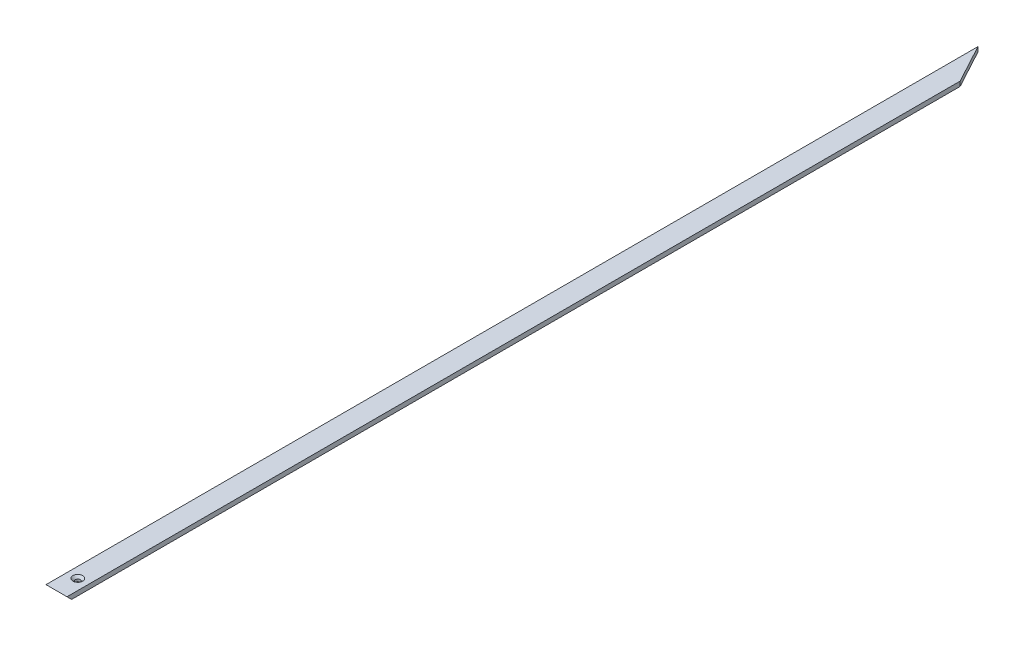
ISO-10303-21;
HEADER;
FILE_DESCRIPTION(('STEP AP214'),'2;1');
FILE_NAME('part.step','',(''),(''),'','','');
FILE_SCHEMA(('AUTOMOTIVE_DESIGN { 1 0 10303 214 1 1 1 1 }'));
ENDSEC;
DATA;
#1=APPLICATION_CONTEXT('core data for automotive mechanical design processes');
#2=APPLICATION_PROTOCOL_DEFINITION('international standard','automotive_design',2000,#1);
#3=PRODUCT_CONTEXT('',#1,'mechanical');
#4=PRODUCT('Part','Part','',(#3));
#5=PRODUCT_RELATED_PRODUCT_CATEGORY('part','',(#4));
#6=PRODUCT_DEFINITION_FORMATION('','',#4);
#7=PRODUCT_DEFINITION_CONTEXT('part definition',#1,'design');
#8=PRODUCT_DEFINITION('design','',#6,#7);
#9=PRODUCT_DEFINITION_SHAPE('','',#8);
#10=(LENGTH_UNIT() NAMED_UNIT(*) SI_UNIT(.MILLI.,.METRE.));
#11=(NAMED_UNIT(*) PLANE_ANGLE_UNIT() SI_UNIT($,.RADIAN.));
#12=(NAMED_UNIT(*) SI_UNIT($,.STERADIAN.) SOLID_ANGLE_UNIT());
#13=UNCERTAINTY_MEASURE_WITH_UNIT(LENGTH_MEASURE(1.E-05),#10,'distance_accuracy_value','');
#14=(GEOMETRIC_REPRESENTATION_CONTEXT(3) GLOBAL_UNCERTAINTY_ASSIGNED_CONTEXT((#13)) GLOBAL_UNIT_ASSIGNED_CONTEXT((#10,
#11,#12)) REPRESENTATION_CONTEXT('',''));
#15=CARTESIAN_POINT('',(0.,0.,0.));
#16=DIRECTION('',(0.,0.,1.));
#17=DIRECTION('',(1.,0.,0.));
#18=AXIS2_PLACEMENT_3D('',#15,#16,#17);
#19=CARTESIAN_POINT('',(-13.5,0.,600.));
#20=DIRECTION('',(1.,0.,0.));
#21=DIRECTION('',(0.,0.,-1.));
#22=AXIS2_PLACEMENT_3D('',#19,#20,#21);
#23=PLANE('',#22);
#24=DIRECTION('',(0.,0.,-1.));
#25=VECTOR('',#24,1.);
#26=CARTESIAN_POINT('',(-13.5,0.,600.));
#27=LINE('',#26,#25);
#28=CARTESIAN_POINT('',(-13.5,0.,594.));
#29=VERTEX_POINT('',#28);
#30=CARTESIAN_POINT('',(-13.5,0.,-600.));
#31=VERTEX_POINT('',#30);
#32=EDGE_CURVE('E74',#29,#31,#27,.T.);
#33=ORIENTED_EDGE('',*,*,#32,.F.);
#34=DIRECTION('',(0.,-0.707106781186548,-0.707106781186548));
#35=VECTOR('',#34,1.);
#36=CARTESIAN_POINT('',(-13.5,6.00000000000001,600.));
#37=LINE('',#36,#35);
#38=CARTESIAN_POINT('',(-13.5,6.,600.));
#39=VERTEX_POINT('',#38);
#40=EDGE_CURVE('E99',#29,#39,#37,.F.);
#41=ORIENTED_EDGE('',*,*,#40,.T.);
#42=DIRECTION('',(0.,0.,-1.));
#43=VECTOR('',#42,1.);
#44=CARTESIAN_POINT('',(-13.5,6.,600.));
#45=LINE('',#44,#43);
#46=CARTESIAN_POINT('',(-13.5,6.,-600.));
#47=VERTEX_POINT('',#46);
#48=EDGE_CURVE('E88',#39,#47,#45,.T.);
#49=ORIENTED_EDGE('',*,*,#48,.T.);
#50=DIRECTION('',(0.,-1.,0.));
#51=VECTOR('',#50,1.);
#52=CARTESIAN_POINT('',(-13.5,0.,-600.));
#53=LINE('',#52,#51);
#54=EDGE_CURVE('E86',#47,#31,#53,.T.);
#55=ORIENTED_EDGE('',*,*,#54,.T.);
#56=EDGE_LOOP('',(#33,#41,#49,#55));
#57=FACE_BOUND('',#56,.T.);
#58=ADVANCED_FACE('F36',(#57),#23,.F.);
#59=CARTESIAN_POINT('',(-13.5,0.,600.));
#60=DIRECTION('',(0.,1.,0.));
#61=DIRECTION('',(0.,0.,1.));
#62=AXIS2_PLACEMENT_3D('',#59,#60,#61);
#63=PLANE('',#62);
#64=CARTESIAN_POINT('',(0.,0.,572.5));
#65=DIRECTION('',(0.,1.,0.));
#66=DIRECTION('',(0.,0.,1.));
#67=AXIS2_PLACEMENT_3D('',#64,#65,#66);
#68=CIRCLE('',#67,3.25);
#69=CARTESIAN_POINT('',(0.,0.,575.75));
#70=VERTEX_POINT('',#69);
#71=EDGE_CURVE('E126',#70,#70,#68,.T.);
#72=ORIENTED_EDGE('',*,*,#71,.T.);
#73=EDGE_LOOP('',(#72));
#74=FACE_BOUND('',#73,.T.);
#75=ORIENTED_EDGE('',*,*,#32,.T.);
#76=DIRECTION('',(0.475148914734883,0.,0.879905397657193));
#77=VECTOR('',#76,1.);
#78=CARTESIAN_POINT('',(13.5,0.,-550.));
#79=LINE('',#78,#77);
#80=CARTESIAN_POINT('',(13.5000000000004,0.,-549.999999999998));
#81=VERTEX_POINT('',#80);
#82=EDGE_CURVE('E11',#31,#81,#79,.T.);
#83=ORIENTED_EDGE('',*,*,#82,.T.);
#84=DIRECTION('',(0.,0.,-1.));
#85=VECTOR('',#84,1.);
#86=CARTESIAN_POINT('',(13.5,0.,600.));
#87=LINE('',#86,#85);
#88=CARTESIAN_POINT('',(13.5,0.,594.));
#89=VERTEX_POINT('',#88);
#90=EDGE_CURVE('E83',#89,#81,#87,.T.);
#91=ORIENTED_EDGE('',*,*,#90,.F.);
#92=DIRECTION('',(-1.,0.,0.));
#93=VECTOR('',#92,1.);
#94=CARTESIAN_POINT('',(-13.5,0.,594.));
#95=LINE('',#94,#93);
#96=EDGE_CURVE('E78',#89,#29,#95,.T.);
#97=ORIENTED_EDGE('',*,*,#96,.T.);
#98=EDGE_LOOP('',(#75,#83,#91,#97));
#99=FACE_BOUND('',#98,.T.);
#100=ADVANCED_FACE('F76',(#74,#99),#63,.F.);
#101=CARTESIAN_POINT('',(13.5,0.,600.));
#102=DIRECTION('',(-1.,0.,0.));
#103=DIRECTION('',(0.,0.,1.));
#104=AXIS2_PLACEMENT_3D('',#101,#102,#103);
#105=PLANE('',#104);
#106=ORIENTED_EDGE('',*,*,#90,.T.);
#107=DIRECTION('',(0.,1.,0.));
#108=VECTOR('',#107,1.);
#109=CARTESIAN_POINT('',(13.5,6.,-550.));
#110=LINE('',#109,#108);
#111=CARTESIAN_POINT('',(13.5000000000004,6.,-549.999999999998));
#112=VERTEX_POINT('',#111);
#113=EDGE_CURVE('E94',#81,#112,#110,.T.);
#114=ORIENTED_EDGE('',*,*,#113,.T.);
#115=DIRECTION('',(0.,0.,-1.));
#116=VECTOR('',#115,1.);
#117=CARTESIAN_POINT('',(13.5,6.,600.));
#118=LINE('',#117,#116);
#119=CARTESIAN_POINT('',(13.5,6.,600.));
#120=VERTEX_POINT('',#119);
#121=EDGE_CURVE('E111',#120,#112,#118,.T.);
#122=ORIENTED_EDGE('',*,*,#121,.F.);
#123=DIRECTION('',(0.,0.707106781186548,0.707106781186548));
#124=VECTOR('',#123,1.);
#125=CARTESIAN_POINT('',(13.5,6.00000000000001,600.));
#126=LINE('',#125,#124);
#127=EDGE_CURVE('E82',#120,#89,#126,.F.);
#128=ORIENTED_EDGE('',*,*,#127,.T.);
#129=EDGE_LOOP('',(#106,#114,#122,#128));
#130=FACE_BOUND('',#129,.T.);
#131=ADVANCED_FACE('F148',(#130),#105,.F.);
#132=CARTESIAN_POINT('',(-13.5,6.,600.));
#133=DIRECTION('',(0.,-1.,0.));
#134=DIRECTION('',(0.,0.,-1.));
#135=AXIS2_PLACEMENT_3D('',#132,#133,#134);
#136=PLANE('',#135);
#137=CARTESIAN_POINT('',(0.,6.,572.5));
#138=DIRECTION('',(0.,1.,0.));
#139=DIRECTION('',(0.,0.,1.));
#140=AXIS2_PLACEMENT_3D('',#137,#138,#139);
#141=CIRCLE('',#140,6.3);
#142=CARTESIAN_POINT('',(0.,6.,578.8));
#143=VERTEX_POINT('',#142);
#144=EDGE_CURVE('E91',#143,#143,#141,.T.);
#145=ORIENTED_EDGE('',*,*,#144,.F.);
#146=EDGE_LOOP('',(#145));
#147=FACE_BOUND('',#146,.T.);
#148=ORIENTED_EDGE('',*,*,#121,.T.);
#149=DIRECTION('',(-0.475148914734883,0.,-0.879905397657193));
#150=VECTOR('',#149,1.);
#151=CARTESIAN_POINT('',(13.5,6.,-550.));
#152=LINE('',#151,#150);
#153=EDGE_CURVE('E44',#112,#47,#152,.T.);
#154=ORIENTED_EDGE('',*,*,#153,.T.);
#155=ORIENTED_EDGE('',*,*,#48,.F.);
#156=DIRECTION('',(-1.,0.,0.));
#157=VECTOR('',#156,1.);
#158=CARTESIAN_POINT('',(-13.5,6.,600.));
#159=LINE('',#158,#157);
#160=EDGE_CURVE('E90',#120,#39,#159,.T.);
#161=ORIENTED_EDGE('',*,*,#160,.F.);
#162=EDGE_LOOP('',(#148,#154,#155,#161));
#163=FACE_BOUND('',#162,.T.);
#164=ADVANCED_FACE('F144',(#147,#163),#136,.F.);
#165=CARTESIAN_POINT('',(-13.5,6.00000000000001,600.));
#166=DIRECTION('',(0.,0.707106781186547,-0.707106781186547));
#167=DIRECTION('',(0.,0.707106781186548,0.707106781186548));
#168=AXIS2_PLACEMENT_3D('',#165,#166,#167);
#169=PLANE('',#168);
#170=ORIENTED_EDGE('',*,*,#40,.F.);
#171=ORIENTED_EDGE('',*,*,#96,.F.);
#172=ORIENTED_EDGE('',*,*,#127,.F.);
#173=ORIENTED_EDGE('',*,*,#160,.T.);
#174=EDGE_LOOP('',(#170,#171,#172,#173));
#175=FACE_BOUND('',#174,.T.);
#176=ADVANCED_FACE('F147',(#175),#169,.F.);
#177=CARTESIAN_POINT('',(13.5,0.,-550.));
#178=DIRECTION('',(0.879905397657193,0.,-0.475148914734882));
#179=DIRECTION('',(-0.475148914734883,0.,-0.879905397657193));
#180=AXIS2_PLACEMENT_3D('',#177,#178,#179);
#181=PLANE('',#180);
#182=ORIENTED_EDGE('',*,*,#82,.F.);
#183=ORIENTED_EDGE('',*,*,#54,.F.);
#184=ORIENTED_EDGE('',*,*,#153,.F.);
#185=ORIENTED_EDGE('',*,*,#113,.F.);
#186=EDGE_LOOP('',(#182,#183,#184,#185));
#187=FACE_BOUND('',#186,.T.);
#188=ADVANCED_FACE('F93',(#187),#181,.T.);
#189=CARTESIAN_POINT('',(0.,6.,572.5));
#190=DIRECTION('',(0.,1.,0.));
#191=DIRECTION('',(0.,0.,1.));
#192=AXIS2_PLACEMENT_3D('',#189,#190,#191);
#193=CONICAL_SURFACE('',#192,6.3,0.785398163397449);
#194=CARTESIAN_POINT('',(0.,2.95,572.5));
#195=DIRECTION('',(0.,1.,0.));
#196=DIRECTION('',(0.,0.,1.));
#197=AXIS2_PLACEMENT_3D('',#194,#195,#196);
#198=CIRCLE('',#197,3.25);
#199=CARTESIAN_POINT('',(0.,2.95,575.75));
#200=VERTEX_POINT('',#199);
#201=EDGE_CURVE('E122',#200,#200,#198,.T.);
#202=ORIENTED_EDGE('',*,*,#201,.F.);
#203=EDGE_LOOP('',(#202));
#204=FACE_BOUND('',#203,.T.);
#205=ORIENTED_EDGE('',*,*,#144,.T.);
#206=EDGE_LOOP('',(#205));
#207=FACE_BOUND('',#206,.T.);
#208=ADVANCED_FACE('F135',(#204,#207),#193,.F.);
#209=CARTESIAN_POINT('',(0.,6.,572.5));
#210=DIRECTION('',(0.,1.,0.));
#211=DIRECTION('',(0.,0.,1.));
#212=AXIS2_PLACEMENT_3D('',#209,#210,#211);
#213=CYLINDRICAL_SURFACE('',#212,3.25);
#214=ORIENTED_EDGE('',*,*,#71,.F.);
#215=EDGE_LOOP('',(#214));
#216=FACE_BOUND('',#215,.T.);
#217=ORIENTED_EDGE('',*,*,#201,.T.);
#218=EDGE_LOOP('',(#217));
#219=FACE_BOUND('',#218,.T.);
#220=ADVANCED_FACE('F132',(#216,#219),#213,.F.);
#221=CLOSED_SHELL('',(#58,#100,#131,#164,#176,#188,#208,#220));
#222=MANIFOLD_SOLID_BREP('B2',#221);
#223=ADVANCED_BREP_SHAPE_REPRESENTATION('',(#18,#222),#14);
#224=SHAPE_DEFINITION_REPRESENTATION(#9,#223);
ENDSEC;
END-ISO-10303-21;
